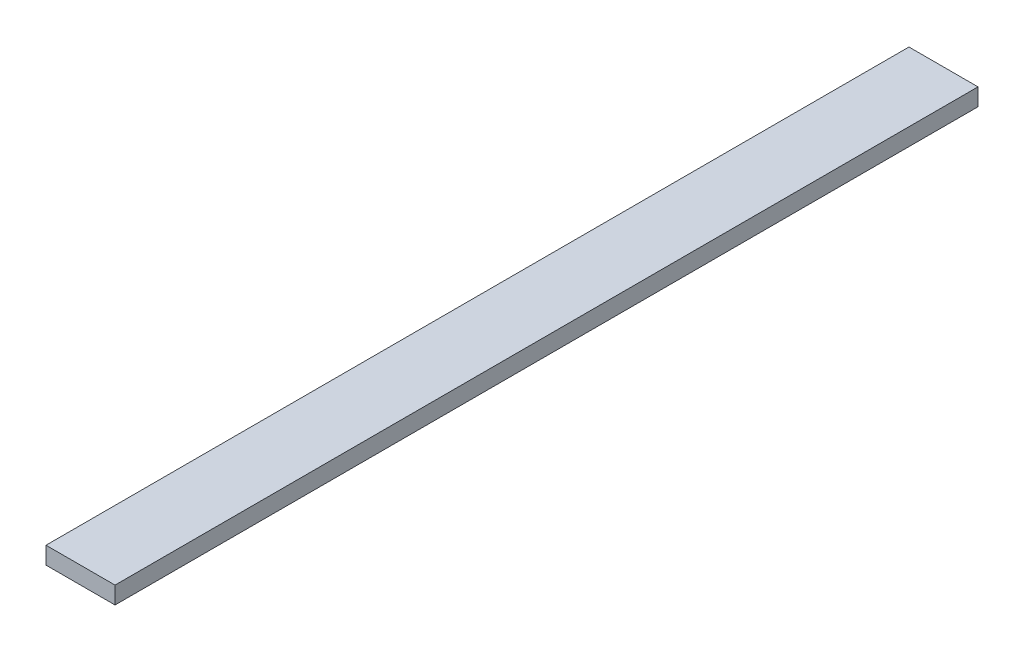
from build123d import *

# Parameters (mm, degrees)
ESQUISSE1_W      = 8
ESQUISSE1_H      = 2
EXTRUSION1_DEPTH = 100


with BuildPart() as part:
    # Esquisse1 → Extrusion1 (new body)
    with BuildSketch(Plane.XY):
        with Locations((4, 1)):
            Rectangle(ESQUISSE1_W, ESQUISSE1_H)
    extrude(amount=EXTRUSION1_DEPTH)


solid = part.part
